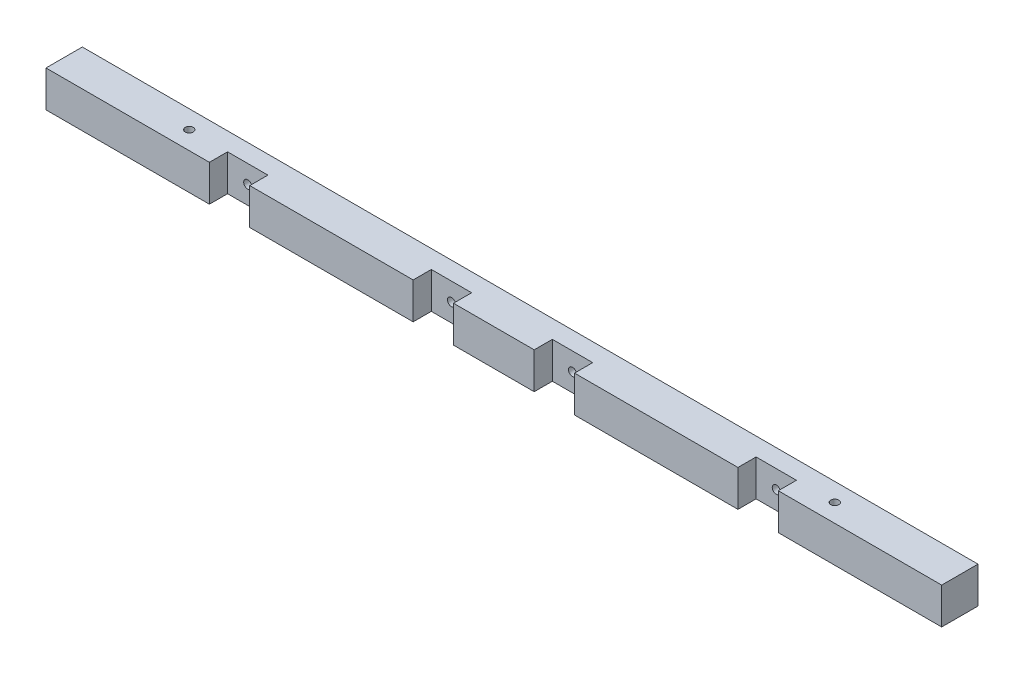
ISO-10303-21;
HEADER;
FILE_DESCRIPTION(('STEP AP214'),'2;1');
FILE_NAME('part.step','',(''),(''),'','','');
FILE_SCHEMA(('AUTOMOTIVE_DESIGN { 1 0 10303 214 1 1 1 1 }'));
ENDSEC;
DATA;
#1=APPLICATION_CONTEXT('core data for automotive mechanical design processes');
#2=APPLICATION_PROTOCOL_DEFINITION('international standard','automotive_design',2000,#1);
#3=PRODUCT_CONTEXT('',#1,'mechanical');
#4=PRODUCT('Part','Part','',(#3));
#5=PRODUCT_RELATED_PRODUCT_CATEGORY('part','',(#4));
#6=PRODUCT_DEFINITION_FORMATION('','',#4);
#7=PRODUCT_DEFINITION_CONTEXT('part definition',#1,'design');
#8=PRODUCT_DEFINITION('design','',#6,#7);
#9=PRODUCT_DEFINITION_SHAPE('','',#8);
#10=(LENGTH_UNIT() NAMED_UNIT(*) SI_UNIT(.MILLI.,.METRE.));
#11=(NAMED_UNIT(*) PLANE_ANGLE_UNIT() SI_UNIT($,.RADIAN.));
#12=(NAMED_UNIT(*) SI_UNIT($,.STERADIAN.) SOLID_ANGLE_UNIT());
#13=UNCERTAINTY_MEASURE_WITH_UNIT(LENGTH_MEASURE(1.E-05),#10,'distance_accuracy_value','');
#14=(GEOMETRIC_REPRESENTATION_CONTEXT(3) GLOBAL_UNCERTAINTY_ASSIGNED_CONTEXT((#13)) GLOBAL_UNIT_ASSIGNED_CONTEXT((#10,
#11,#12)) REPRESENTATION_CONTEXT('',''));
#15=CARTESIAN_POINT('',(0.,0.,0.));
#16=DIRECTION('',(0.,0.,1.));
#17=DIRECTION('',(1.,0.,0.));
#18=AXIS2_PLACEMENT_3D('',#15,#16,#17);
#19=CARTESIAN_POINT('',(0.,9.,9.));
#20=DIRECTION('',(0.,0.,-1.));
#21=DIRECTION('',(-1.,0.,0.));
#22=AXIS2_PLACEMENT_3D('',#19,#20,#21);
#23=PLANE('',#22);
#24=DIRECTION('',(1.,0.,0.));
#25=VECTOR('',#24,1.);
#26=CARTESIAN_POINT('',(0.,0.,9.));
#27=LINE('',#26,#25);
#28=CARTESIAN_POINT('',(131.,0.,9.));
#29=VERTEX_POINT('',#28);
#30=CARTESIAN_POINT('',(171.5,0.,9.));
#31=VERTEX_POINT('',#30);
#32=EDGE_CURVE('E374',#29,#31,#27,.T.);
#33=ORIENTED_EDGE('',*,*,#32,.T.);
#34=DIRECTION('',(0.,-1.,0.));
#35=VECTOR('',#34,1.);
#36=CARTESIAN_POINT('',(171.5,0.,9.));
#37=LINE('',#36,#35);
#38=CARTESIAN_POINT('',(171.5,9.,9.));
#39=VERTEX_POINT('',#38);
#40=EDGE_CURVE('E174',#39,#31,#37,.T.);
#41=ORIENTED_EDGE('',*,*,#40,.F.);
#42=DIRECTION('',(-1.,0.,0.));
#43=VECTOR('',#42,1.);
#44=CARTESIAN_POINT('',(0.,9.,9.));
#45=LINE('',#44,#43);
#46=CARTESIAN_POINT('',(131.,9.,9.));
#47=VERTEX_POINT('',#46);
#48=EDGE_CURVE('E321',#39,#47,#45,.T.);
#49=ORIENTED_EDGE('',*,*,#48,.T.);
#50=DIRECTION('',(0.,1.,0.));
#51=VECTOR('',#50,1.);
#52=CARTESIAN_POINT('',(131.,0.,9.));
#53=LINE('',#52,#51);
#54=EDGE_CURVE('E218',#29,#47,#53,.T.);
#55=ORIENTED_EDGE('',*,*,#54,.F.);
#56=EDGE_LOOP('',(#33,#41,#49,#55));
#57=FACE_BOUND('',#56,.T.);
#58=ADVANCED_FACE('F31',(#57),#23,.F.);
#59=CARTESIAN_POINT('',(101.,0.,9.));
#60=VERTEX_POINT('',#59);
#61=CARTESIAN_POINT('',(121.,0.,9.));
#62=VERTEX_POINT('',#61);
#63=EDGE_CURVE('E375',#60,#62,#27,.T.);
#64=ORIENTED_EDGE('',*,*,#63,.T.);
#65=DIRECTION('',(0.,-1.,0.));
#66=VECTOR('',#65,1.);
#67=CARTESIAN_POINT('',(121.,0.,9.));
#68=LINE('',#67,#66);
#69=CARTESIAN_POINT('',(121.,9.,9.));
#70=VERTEX_POINT('',#69);
#71=EDGE_CURVE('E211',#70,#62,#68,.T.);
#72=ORIENTED_EDGE('',*,*,#71,.F.);
#73=CARTESIAN_POINT('',(101.,9.,9.));
#74=VERTEX_POINT('',#73);
#75=EDGE_CURVE('E358',#70,#74,#45,.T.);
#76=ORIENTED_EDGE('',*,*,#75,.T.);
#77=DIRECTION('',(0.,1.,0.));
#78=VECTOR('',#77,1.);
#79=CARTESIAN_POINT('',(101.,0.,9.));
#80=LINE('',#79,#78);
#81=EDGE_CURVE('E249',#60,#74,#80,.T.);
#82=ORIENTED_EDGE('',*,*,#81,.F.);
#83=EDGE_LOOP('',(#64,#72,#76,#82));
#84=FACE_BOUND('',#83,.T.);
#85=ADVANCED_FACE('F392',(#84),#23,.F.);
#86=CARTESIAN_POINT('',(50.5,0.,9.));
#87=VERTEX_POINT('',#86);
#88=CARTESIAN_POINT('',(91.,0.,9.));
#89=VERTEX_POINT('',#88);
#90=EDGE_CURVE('E314',#87,#89,#27,.T.);
#91=ORIENTED_EDGE('',*,*,#90,.T.);
#92=DIRECTION('',(0.,-1.,0.));
#93=VECTOR('',#92,1.);
#94=CARTESIAN_POINT('',(91.,0.,9.));
#95=LINE('',#94,#93);
#96=CARTESIAN_POINT('',(91.,9.,9.));
#97=VERTEX_POINT('',#96);
#98=EDGE_CURVE('E242',#97,#89,#95,.T.);
#99=ORIENTED_EDGE('',*,*,#98,.F.);
#100=CARTESIAN_POINT('',(50.5,9.,9.));
#101=VERTEX_POINT('',#100);
#102=EDGE_CURVE('E357',#97,#101,#45,.T.);
#103=ORIENTED_EDGE('',*,*,#102,.T.);
#104=DIRECTION('',(0.,1.,0.));
#105=VECTOR('',#104,1.);
#106=CARTESIAN_POINT('',(50.5,9.,9.));
#107=LINE('',#106,#105);
#108=EDGE_CURVE('E282',#87,#101,#107,.T.);
#109=ORIENTED_EDGE('',*,*,#108,.F.);
#110=EDGE_LOOP('',(#91,#99,#103,#109));
#111=FACE_BOUND('',#110,.T.);
#112=ADVANCED_FACE('F397',(#111),#23,.F.);
#113=CARTESIAN_POINT('',(0.,0.,9.));
#114=VERTEX_POINT('',#113);
#115=CARTESIAN_POINT('',(40.5,0.,9.));
#116=VERTEX_POINT('',#115);
#117=EDGE_CURVE('E310',#114,#116,#27,.T.);
#118=ORIENTED_EDGE('',*,*,#117,.T.);
#119=DIRECTION('',(0.,-1.,0.));
#120=VECTOR('',#119,1.);
#121=CARTESIAN_POINT('',(40.5,9.,9.));
#122=LINE('',#121,#120);
#123=CARTESIAN_POINT('',(40.5,9.,9.));
#124=VERTEX_POINT('',#123);
#125=EDGE_CURVE('E275',#124,#116,#122,.T.);
#126=ORIENTED_EDGE('',*,*,#125,.F.);
#127=CARTESIAN_POINT('',(0.,9.,9.));
#128=VERTEX_POINT('',#127);
#129=EDGE_CURVE('E316',#124,#128,#45,.T.);
#130=ORIENTED_EDGE('',*,*,#129,.T.);
#131=DIRECTION('',(0.,-1.,0.));
#132=VECTOR('',#131,1.);
#133=CARTESIAN_POINT('',(0.,0.,9.));
#134=LINE('',#133,#132);
#135=EDGE_CURVE('E305',#128,#114,#134,.T.);
#136=ORIENTED_EDGE('',*,*,#135,.T.);
#137=EDGE_LOOP('',(#118,#126,#130,#136));
#138=FACE_BOUND('',#137,.T.);
#139=ADVANCED_FACE('F354',(#138),#23,.F.);
#140=CARTESIAN_POINT('',(0.,0.,9.));
#141=DIRECTION('',(1.,0.,0.));
#142=DIRECTION('',(0.,0.,-1.));
#143=AXIS2_PLACEMENT_3D('',#140,#141,#142);
#144=PLANE('',#143);
#145=DIRECTION('',(0.,-1.,0.));
#146=VECTOR('',#145,1.);
#147=CARTESIAN_POINT('',(0.,0.,0.));
#148=LINE('',#147,#146);
#149=CARTESIAN_POINT('',(0.,9.,0.));
#150=VERTEX_POINT('',#149);
#151=CARTESIAN_POINT('',(0.,0.,0.));
#152=VERTEX_POINT('',#151);
#153=EDGE_CURVE('E297',#150,#152,#148,.T.);
#154=ORIENTED_EDGE('',*,*,#153,.T.);
#155=DIRECTION('',(0.,0.,-1.));
#156=VECTOR('',#155,1.);
#157=CARTESIAN_POINT('',(0.,0.,9.));
#158=LINE('',#157,#156);
#159=EDGE_CURVE('E11',#114,#152,#158,.T.);
#160=ORIENTED_EDGE('',*,*,#159,.F.);
#161=ORIENTED_EDGE('',*,*,#135,.F.);
#162=DIRECTION('',(0.,0.,-1.));
#163=VECTOR('',#162,1.);
#164=CARTESIAN_POINT('',(0.,9.,9.));
#165=LINE('',#164,#163);
#166=EDGE_CURVE('E320',#128,#150,#165,.T.);
#167=ORIENTED_EDGE('',*,*,#166,.T.);
#168=EDGE_LOOP('',(#154,#160,#161,#167));
#169=FACE_BOUND('',#168,.T.);
#170=ADVANCED_FACE('F33',(#169),#144,.F.);
#171=CARTESIAN_POINT('',(0.,0.,9.));
#172=DIRECTION('',(0.,1.,0.));
#173=DIRECTION('',(0.,0.,1.));
#174=AXIS2_PLACEMENT_3D('',#171,#172,#173);
#175=PLANE('',#174);
#176=CARTESIAN_POINT('',(191.,0.,4.5));
#177=DIRECTION('',(0.,1.,0.));
#178=DIRECTION('',(0.,0.,1.));
#179=AXIS2_PLACEMENT_3D('',#176,#177,#178);
#180=CIRCLE('',#179,0.999999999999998);
#181=CARTESIAN_POINT('',(191.,0.,5.5));
#182=VERTEX_POINT('',#181);
#183=EDGE_CURVE('E564',#182,#182,#180,.T.);
#184=ORIENTED_EDGE('',*,*,#183,.T.);
#185=EDGE_LOOP('',(#184));
#186=FACE_BOUND('',#185,.T.);
#187=CARTESIAN_POINT('',(31.,0.,4.5));
#188=DIRECTION('',(0.,1.,0.));
#189=DIRECTION('',(0.,0.,1.));
#190=AXIS2_PLACEMENT_3D('',#187,#188,#189);
#191=CIRCLE('',#190,0.999999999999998);
#192=CARTESIAN_POINT('',(31.,0.,5.5));
#193=VERTEX_POINT('',#192);
#194=EDGE_CURVE('E572',#193,#193,#191,.T.);
#195=ORIENTED_EDGE('',*,*,#194,.T.);
#196=EDGE_LOOP('',(#195));
#197=FACE_BOUND('',#196,.T.);
#198=DIRECTION('',(1.,0.,0.));
#199=VECTOR('',#198,1.);
#200=CARTESIAN_POINT('',(171.5,0.,4.5));
#201=LINE('',#200,#199);
#202=CARTESIAN_POINT('',(171.5,0.,4.5));
#203=VERTEX_POINT('',#202);
#204=CARTESIAN_POINT('',(181.5,0.,4.5));
#205=VERTEX_POINT('',#204);
#206=EDGE_CURVE('E185',#203,#205,#201,.T.);
#207=ORIENTED_EDGE('',*,*,#206,.F.);
#208=DIRECTION('',(0.,0.,1.));
#209=VECTOR('',#208,1.);
#210=CARTESIAN_POINT('',(171.5,0.,4.5));
#211=LINE('',#210,#209);
#212=EDGE_CURVE('E168',#203,#31,#211,.T.);
#213=ORIENTED_EDGE('',*,*,#212,.T.);
#214=ORIENTED_EDGE('',*,*,#32,.F.);
#215=DIRECTION('',(0.,0.,1.));
#216=VECTOR('',#215,1.);
#217=CARTESIAN_POINT('',(131.,0.,4.5));
#218=LINE('',#217,#216);
#219=CARTESIAN_POINT('',(131.,0.,4.5));
#220=VERTEX_POINT('',#219);
#221=EDGE_CURVE('E54',#220,#29,#218,.T.);
#222=ORIENTED_EDGE('',*,*,#221,.F.);
#223=DIRECTION('',(1.,0.,0.));
#224=VECTOR('',#223,1.);
#225=CARTESIAN_POINT('',(121.,0.,4.5));
#226=LINE('',#225,#224);
#227=CARTESIAN_POINT('',(121.,0.,4.5));
#228=VERTEX_POINT('',#227);
#229=EDGE_CURVE('E217',#228,#220,#226,.T.);
#230=ORIENTED_EDGE('',*,*,#229,.F.);
#231=DIRECTION('',(0.,0.,1.));
#232=VECTOR('',#231,1.);
#233=CARTESIAN_POINT('',(121.,0.,4.5));
#234=LINE('',#233,#232);
#235=EDGE_CURVE('E227',#228,#62,#234,.T.);
#236=ORIENTED_EDGE('',*,*,#235,.T.);
#237=ORIENTED_EDGE('',*,*,#63,.F.);
#238=DIRECTION('',(0.,0.,1.));
#239=VECTOR('',#238,1.);
#240=CARTESIAN_POINT('',(101.,0.,4.5));
#241=LINE('',#240,#239);
#242=CARTESIAN_POINT('',(101.,0.,4.5));
#243=VERTEX_POINT('',#242);
#244=EDGE_CURVE('E268',#243,#60,#241,.T.);
#245=ORIENTED_EDGE('',*,*,#244,.F.);
#246=DIRECTION('',(1.,0.,0.));
#247=VECTOR('',#246,1.);
#248=CARTESIAN_POINT('',(91.,0.,4.5));
#249=LINE('',#248,#247);
#250=CARTESIAN_POINT('',(91.,0.,4.5));
#251=VERTEX_POINT('',#250);
#252=EDGE_CURVE('E248',#251,#243,#249,.T.);
#253=ORIENTED_EDGE('',*,*,#252,.F.);
#254=DIRECTION('',(0.,0.,1.));
#255=VECTOR('',#254,1.);
#256=CARTESIAN_POINT('',(91.,0.,4.5));
#257=LINE('',#256,#255);
#258=EDGE_CURVE('E258',#251,#89,#257,.T.);
#259=ORIENTED_EDGE('',*,*,#258,.T.);
#260=ORIENTED_EDGE('',*,*,#90,.F.);
#261=DIRECTION('',(0.,0.,1.));
#262=VECTOR('',#261,1.);
#263=CARTESIAN_POINT('',(50.5,0.,4.5));
#264=LINE('',#263,#262);
#265=CARTESIAN_POINT('',(50.5,0.,4.5));
#266=VERTEX_POINT('',#265);
#267=EDGE_CURVE('E301',#266,#87,#264,.T.);
#268=ORIENTED_EDGE('',*,*,#267,.F.);
#269=DIRECTION('',(1.,0.,0.));
#270=VECTOR('',#269,1.);
#271=CARTESIAN_POINT('',(40.5,0.,4.5));
#272=LINE('',#271,#270);
#273=CARTESIAN_POINT('',(40.5,0.,4.5));
#274=VERTEX_POINT('',#273);
#275=EDGE_CURVE('E281',#274,#266,#272,.T.);
#276=ORIENTED_EDGE('',*,*,#275,.F.);
#277=DIRECTION('',(0.,0.,1.));
#278=VECTOR('',#277,1.);
#279=CARTESIAN_POINT('',(40.5,0.,4.5));
#280=LINE('',#279,#278);
#281=EDGE_CURVE('E291',#274,#116,#280,.T.);
#282=ORIENTED_EDGE('',*,*,#281,.T.);
#283=ORIENTED_EDGE('',*,*,#117,.F.);
#284=ORIENTED_EDGE('',*,*,#159,.T.);
#285=DIRECTION('',(1.,0.,0.));
#286=VECTOR('',#285,1.);
#287=CARTESIAN_POINT('',(0.,0.,0.));
#288=LINE('',#287,#286);
#289=CARTESIAN_POINT('',(222.,0.,0.));
#290=VERTEX_POINT('',#289);
#291=EDGE_CURVE('E324',#152,#290,#288,.T.);
#292=ORIENTED_EDGE('',*,*,#291,.T.);
#293=DIRECTION('',(0.,0.,-1.));
#294=VECTOR('',#293,1.);
#295=CARTESIAN_POINT('',(222.,0.,9.));
#296=LINE('',#295,#294);
#297=CARTESIAN_POINT('',(222.,0.,9.));
#298=VERTEX_POINT('',#297);
#299=EDGE_CURVE('E39',#298,#290,#296,.T.);
#300=ORIENTED_EDGE('',*,*,#299,.F.);
#301=CARTESIAN_POINT('',(181.5,0.,9.));
#302=VERTEX_POINT('',#301);
#303=EDGE_CURVE('E308',#302,#298,#27,.T.);
#304=ORIENTED_EDGE('',*,*,#303,.F.);
#305=DIRECTION('',(0.,0.,1.));
#306=VECTOR('',#305,1.);
#307=CARTESIAN_POINT('',(181.5,0.,4.5));
#308=LINE('',#307,#306);
#309=EDGE_CURVE('E46',#205,#302,#308,.T.);
#310=ORIENTED_EDGE('',*,*,#309,.F.);
#311=EDGE_LOOP('',(#207,#213,#214,#222,#230,#236,#237,#245,#253,#259,#260,#268,#276,#282,#283,
#284,#292,#300,#304,#310));
#312=FACE_BOUND('',#311,.T.);
#313=ADVANCED_FACE('F190',(#186,#197,#312),#175,.F.);
#314=CARTESIAN_POINT('',(222.,0.,9.));
#315=DIRECTION('',(-1.,0.,0.));
#316=DIRECTION('',(0.,0.,1.));
#317=AXIS2_PLACEMENT_3D('',#314,#315,#316);
#318=PLANE('',#317);
#319=DIRECTION('',(0.,1.,0.));
#320=VECTOR('',#319,1.);
#321=CARTESIAN_POINT('',(222.,0.,0.));
#322=LINE('',#321,#320);
#323=CARTESIAN_POINT('',(222.,9.,0.));
#324=VERTEX_POINT('',#323);
#325=EDGE_CURVE('E326',#290,#324,#322,.T.);
#326=ORIENTED_EDGE('',*,*,#325,.T.);
#327=DIRECTION('',(0.,0.,-1.));
#328=VECTOR('',#327,1.);
#329=CARTESIAN_POINT('',(222.,9.,9.));
#330=LINE('',#329,#328);
#331=CARTESIAN_POINT('',(222.,9.,9.));
#332=VERTEX_POINT('',#331);
#333=EDGE_CURVE('E331',#332,#324,#330,.T.);
#334=ORIENTED_EDGE('',*,*,#333,.F.);
#335=DIRECTION('',(0.,1.,0.));
#336=VECTOR('',#335,1.);
#337=CARTESIAN_POINT('',(222.,0.,9.));
#338=LINE('',#337,#336);
#339=EDGE_CURVE('E313',#298,#332,#338,.T.);
#340=ORIENTED_EDGE('',*,*,#339,.F.);
#341=ORIENTED_EDGE('',*,*,#299,.T.);
#342=EDGE_LOOP('',(#326,#334,#340,#341));
#343=FACE_BOUND('',#342,.T.);
#344=ADVANCED_FACE('F338',(#343),#318,.F.);
#345=CARTESIAN_POINT('',(0.,9.,9.));
#346=DIRECTION('',(0.,-1.,0.));
#347=DIRECTION('',(0.,0.,-1.));
#348=AXIS2_PLACEMENT_3D('',#345,#346,#347);
#349=PLANE('',#348);
#350=CARTESIAN_POINT('',(191.,9.,4.5));
#351=DIRECTION('',(0.,1.,0.));
#352=DIRECTION('',(0.,0.,1.));
#353=AXIS2_PLACEMENT_3D('',#350,#351,#352);
#354=CIRCLE('',#353,0.999999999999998);
#355=CARTESIAN_POINT('',(191.,9.,5.5));
#356=VERTEX_POINT('',#355);
#357=EDGE_CURVE('E567',#356,#356,#354,.T.);
#358=ORIENTED_EDGE('',*,*,#357,.F.);
#359=EDGE_LOOP('',(#358));
#360=FACE_BOUND('',#359,.T.);
#361=CARTESIAN_POINT('',(31.,9.,4.5));
#362=DIRECTION('',(0.,1.,0.));
#363=DIRECTION('',(0.,0.,1.));
#364=AXIS2_PLACEMENT_3D('',#361,#362,#363);
#365=CIRCLE('',#364,0.999999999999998);
#366=CARTESIAN_POINT('',(31.,9.,5.5));
#367=VERTEX_POINT('',#366);
#368=EDGE_CURVE('E569',#367,#367,#365,.T.);
#369=ORIENTED_EDGE('',*,*,#368,.F.);
#370=EDGE_LOOP('',(#369));
#371=FACE_BOUND('',#370,.T.);
#372=ORIENTED_EDGE('',*,*,#48,.F.);
#373=DIRECTION('',(0.,0.,1.));
#374=VECTOR('',#373,1.);
#375=CARTESIAN_POINT('',(171.5,9.,4.5));
#376=LINE('',#375,#374);
#377=CARTESIAN_POINT('',(171.5,9.,4.5));
#378=VERTEX_POINT('',#377);
#379=EDGE_CURVE('E201',#378,#39,#376,.T.);
#380=ORIENTED_EDGE('',*,*,#379,.F.);
#381=DIRECTION('',(-1.,0.,0.));
#382=VECTOR('',#381,1.);
#383=CARTESIAN_POINT('',(171.5,9.,4.5));
#384=LINE('',#383,#382);
#385=CARTESIAN_POINT('',(181.5,9.,4.5));
#386=VERTEX_POINT('',#385);
#387=EDGE_CURVE('E179',#386,#378,#384,.T.);
#388=ORIENTED_EDGE('',*,*,#387,.F.);
#389=DIRECTION('',(0.,0.,1.));
#390=VECTOR('',#389,1.);
#391=CARTESIAN_POINT('',(181.5,9.,4.5));
#392=LINE('',#391,#390);
#393=CARTESIAN_POINT('',(181.5,9.,9.));
#394=VERTEX_POINT('',#393);
#395=EDGE_CURVE('E204',#386,#394,#392,.T.);
#396=ORIENTED_EDGE('',*,*,#395,.T.);
#397=EDGE_CURVE('E317',#332,#394,#45,.T.);
#398=ORIENTED_EDGE('',*,*,#397,.F.);
#399=ORIENTED_EDGE('',*,*,#333,.T.);
#400=DIRECTION('',(-1.,0.,0.));
#401=VECTOR('',#400,1.);
#402=CARTESIAN_POINT('',(0.,9.,0.));
#403=LINE('',#402,#401);
#404=EDGE_CURVE('E309',#324,#150,#403,.T.);
#405=ORIENTED_EDGE('',*,*,#404,.T.);
#406=ORIENTED_EDGE('',*,*,#166,.F.);
#407=ORIENTED_EDGE('',*,*,#129,.F.);
#408=DIRECTION('',(0.,0.,1.));
#409=VECTOR('',#408,1.);
#410=CARTESIAN_POINT('',(40.5,9.,4.5));
#411=LINE('',#410,#409);
#412=CARTESIAN_POINT('',(40.5,9.,4.5));
#413=VERTEX_POINT('',#412);
#414=EDGE_CURVE('E295',#413,#124,#411,.T.);
#415=ORIENTED_EDGE('',*,*,#414,.F.);
#416=DIRECTION('',(-1.,0.,0.));
#417=VECTOR('',#416,1.);
#418=CARTESIAN_POINT('',(40.5,9.,4.5));
#419=LINE('',#418,#417);
#420=CARTESIAN_POINT('',(50.5,9.,4.5));
#421=VERTEX_POINT('',#420);
#422=EDGE_CURVE('E288',#421,#413,#419,.T.);
#423=ORIENTED_EDGE('',*,*,#422,.F.);
#424=DIRECTION('',(0.,0.,1.));
#425=VECTOR('',#424,1.);
#426=CARTESIAN_POINT('',(50.5,9.,4.5));
#427=LINE('',#426,#425);
#428=EDGE_CURVE('E298',#421,#101,#427,.T.);
#429=ORIENTED_EDGE('',*,*,#428,.T.);
#430=ORIENTED_EDGE('',*,*,#102,.F.);
#431=DIRECTION('',(0.,0.,1.));
#432=VECTOR('',#431,1.);
#433=CARTESIAN_POINT('',(91.,9.,4.5));
#434=LINE('',#433,#432);
#435=CARTESIAN_POINT('',(91.,9.,4.5));
#436=VERTEX_POINT('',#435);
#437=EDGE_CURVE('E262',#436,#97,#434,.T.);
#438=ORIENTED_EDGE('',*,*,#437,.F.);
#439=DIRECTION('',(-1.,0.,0.));
#440=VECTOR('',#439,1.);
#441=CARTESIAN_POINT('',(91.,9.,4.5));
#442=LINE('',#441,#440);
#443=CARTESIAN_POINT('',(101.,9.,4.5));
#444=VERTEX_POINT('',#443);
#445=EDGE_CURVE('E255',#444,#436,#442,.T.);
#446=ORIENTED_EDGE('',*,*,#445,.F.);
#447=DIRECTION('',(0.,0.,1.));
#448=VECTOR('',#447,1.);
#449=CARTESIAN_POINT('',(101.,9.,4.5));
#450=LINE('',#449,#448);
#451=EDGE_CURVE('E265',#444,#74,#450,.T.);
#452=ORIENTED_EDGE('',*,*,#451,.T.);
#453=ORIENTED_EDGE('',*,*,#75,.F.);
#454=DIRECTION('',(0.,0.,1.));
#455=VECTOR('',#454,1.);
#456=CARTESIAN_POINT('',(121.,9.,4.5));
#457=LINE('',#456,#455);
#458=CARTESIAN_POINT('',(121.,9.,4.5));
#459=VERTEX_POINT('',#458);
#460=EDGE_CURVE('E230',#459,#70,#457,.T.);
#461=ORIENTED_EDGE('',*,*,#460,.F.);
#462=DIRECTION('',(-1.,0.,0.));
#463=VECTOR('',#462,1.);
#464=CARTESIAN_POINT('',(121.,9.,4.5));
#465=LINE('',#464,#463);
#466=CARTESIAN_POINT('',(131.,9.,4.5));
#467=VERTEX_POINT('',#466);
#468=EDGE_CURVE('E224',#467,#459,#465,.T.);
#469=ORIENTED_EDGE('',*,*,#468,.F.);
#470=DIRECTION('',(0.,0.,1.));
#471=VECTOR('',#470,1.);
#472=CARTESIAN_POINT('',(131.,9.,4.5));
#473=LINE('',#472,#471);
#474=EDGE_CURVE('E233',#467,#47,#473,.T.);
#475=ORIENTED_EDGE('',*,*,#474,.T.);
#476=EDGE_LOOP('',(#372,#380,#388,#396,#398,#399,#405,#406,#407,#415,#423,#429,#430,#438,#446,
#452,#453,#461,#469,#475));
#477=FACE_BOUND('',#476,.T.);
#478=ADVANCED_FACE('F347',(#360,#371,#477),#349,.F.);
#479=ORIENTED_EDGE('',*,*,#397,.T.);
#480=DIRECTION('',(0.,1.,0.));
#481=VECTOR('',#480,1.);
#482=CARTESIAN_POINT('',(181.5,0.,9.));
#483=LINE('',#482,#481);
#484=EDGE_CURVE('E188',#302,#394,#483,.T.);
#485=ORIENTED_EDGE('',*,*,#484,.F.);
#486=ORIENTED_EDGE('',*,*,#303,.T.);
#487=ORIENTED_EDGE('',*,*,#339,.T.);
#488=EDGE_LOOP('',(#479,#485,#486,#487));
#489=FACE_BOUND('',#488,.T.);
#490=ADVANCED_FACE('F378',(#489),#23,.F.);
#491=CARTESIAN_POINT('',(0.,9.,0.));
#492=DIRECTION('',(0.,0.,-1.));
#493=DIRECTION('',(-1.,0.,0.));
#494=AXIS2_PLACEMENT_3D('',#491,#492,#493);
#495=PLANE('',#494);
#496=CARTESIAN_POINT('',(176.5,4.5,0.));
#497=DIRECTION('',(0.,0.,1.));
#498=DIRECTION('',(1.,0.,0.));
#499=AXIS2_PLACEMENT_3D('',#496,#497,#498);
#500=CIRCLE('',#499,0.999999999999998);
#501=CARTESIAN_POINT('',(177.5,4.5,0.));
#502=VERTEX_POINT('',#501);
#503=EDGE_CURVE('E199',#502,#502,#500,.T.);
#504=ORIENTED_EDGE('',*,*,#503,.T.);
#505=EDGE_LOOP('',(#504));
#506=FACE_BOUND('',#505,.T.);
#507=CARTESIAN_POINT('',(126.,4.5,0.));
#508=DIRECTION('',(0.,0.,1.));
#509=DIRECTION('',(1.,0.,0.));
#510=AXIS2_PLACEMENT_3D('',#507,#508,#509);
#511=CIRCLE('',#510,0.999999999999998);
#512=CARTESIAN_POINT('',(127.,4.5,0.));
#513=VERTEX_POINT('',#512);
#514=EDGE_CURVE('E208',#513,#513,#511,.T.);
#515=ORIENTED_EDGE('',*,*,#514,.T.);
#516=EDGE_LOOP('',(#515));
#517=FACE_BOUND('',#516,.T.);
#518=CARTESIAN_POINT('',(96.,4.5,0.));
#519=DIRECTION('',(0.,0.,1.));
#520=DIRECTION('',(1.,0.,0.));
#521=AXIS2_PLACEMENT_3D('',#518,#519,#520);
#522=CIRCLE('',#521,0.999999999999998);
#523=CARTESIAN_POINT('',(97.,4.5,0.));
#524=VERTEX_POINT('',#523);
#525=EDGE_CURVE('E239',#524,#524,#522,.T.);
#526=ORIENTED_EDGE('',*,*,#525,.T.);
#527=EDGE_LOOP('',(#526));
#528=FACE_BOUND('',#527,.T.);
#529=CARTESIAN_POINT('',(45.5,4.5,0.));
#530=DIRECTION('',(0.,0.,1.));
#531=DIRECTION('',(1.,0.,0.));
#532=AXIS2_PLACEMENT_3D('',#529,#530,#531);
#533=CIRCLE('',#532,0.999999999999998);
#534=CARTESIAN_POINT('',(46.5,4.5,0.));
#535=VERTEX_POINT('',#534);
#536=EDGE_CURVE('E272',#535,#535,#533,.T.);
#537=ORIENTED_EDGE('',*,*,#536,.T.);
#538=EDGE_LOOP('',(#537));
#539=FACE_BOUND('',#538,.T.);
#540=ORIENTED_EDGE('',*,*,#153,.F.);
#541=ORIENTED_EDGE('',*,*,#404,.F.);
#542=ORIENTED_EDGE('',*,*,#325,.F.);
#543=ORIENTED_EDGE('',*,*,#291,.F.);
#544=EDGE_LOOP('',(#540,#541,#542,#543));
#545=FACE_BOUND('',#544,.T.);
#546=ADVANCED_FACE('F343',(#506,#517,#528,#539,#545),#495,.T.);
#547=CARTESIAN_POINT('',(40.5,9.,4.5));
#548=DIRECTION('',(-1.,0.,0.));
#549=DIRECTION('',(0.,0.,1.));
#550=AXIS2_PLACEMENT_3D('',#547,#548,#549);
#551=PLANE('',#550);
#552=ORIENTED_EDGE('',*,*,#125,.T.);
#553=ORIENTED_EDGE('',*,*,#281,.F.);
#554=DIRECTION('',(0.,-1.,0.));
#555=VECTOR('',#554,1.);
#556=CARTESIAN_POINT('',(40.5,9.,4.5));
#557=LINE('',#556,#555);
#558=EDGE_CURVE('E278',#413,#274,#557,.T.);
#559=ORIENTED_EDGE('',*,*,#558,.F.);
#560=ORIENTED_EDGE('',*,*,#414,.T.);
#561=EDGE_LOOP('',(#552,#553,#559,#560));
#562=FACE_BOUND('',#561,.T.);
#563=ADVANCED_FACE('F405',(#562),#551,.F.);
#564=CARTESIAN_POINT('',(50.5,9.,4.5));
#565=DIRECTION('',(1.,0.,0.));
#566=DIRECTION('',(0.,0.,-1.));
#567=AXIS2_PLACEMENT_3D('',#564,#565,#566);
#568=PLANE('',#567);
#569=ORIENTED_EDGE('',*,*,#108,.T.);
#570=ORIENTED_EDGE('',*,*,#428,.F.);
#571=DIRECTION('',(0.,1.,0.));
#572=VECTOR('',#571,1.);
#573=CARTESIAN_POINT('',(50.5,9.,4.5));
#574=LINE('',#573,#572);
#575=EDGE_CURVE('E285',#266,#421,#574,.T.);
#576=ORIENTED_EDGE('',*,*,#575,.F.);
#577=ORIENTED_EDGE('',*,*,#267,.T.);
#578=EDGE_LOOP('',(#569,#570,#576,#577));
#579=FACE_BOUND('',#578,.T.);
#580=ADVANCED_FACE('F430',(#579),#568,.F.);
#581=CARTESIAN_POINT('',(40.5,0.,4.5));
#582=DIRECTION('',(0.,0.,1.));
#583=DIRECTION('',(1.,0.,0.));
#584=AXIS2_PLACEMENT_3D('',#581,#582,#583);
#585=PLANE('',#584);
#586=CARTESIAN_POINT('',(45.5,4.5,4.5));
#587=DIRECTION('',(0.,0.,1.));
#588=DIRECTION('',(1.,0.,0.));
#589=AXIS2_PLACEMENT_3D('',#586,#587,#588);
#590=CIRCLE('',#589,0.999999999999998);
#591=CARTESIAN_POINT('',(46.5,4.5,4.5));
#592=VERTEX_POINT('',#591);
#593=EDGE_CURVE('E264',#592,#592,#590,.T.);
#594=ORIENTED_EDGE('',*,*,#593,.F.);
#595=EDGE_LOOP('',(#594));
#596=FACE_BOUND('',#595,.T.);
#597=ORIENTED_EDGE('',*,*,#558,.T.);
#598=ORIENTED_EDGE('',*,*,#275,.T.);
#599=ORIENTED_EDGE('',*,*,#575,.T.);
#600=ORIENTED_EDGE('',*,*,#422,.T.);
#601=EDGE_LOOP('',(#597,#598,#599,#600));
#602=FACE_BOUND('',#601,.T.);
#603=ADVANCED_FACE('F432',(#596,#602),#585,.T.);
#604=CARTESIAN_POINT('',(45.5,4.5,0.));
#605=DIRECTION('',(0.,0.,1.));
#606=DIRECTION('',(1.,0.,0.));
#607=AXIS2_PLACEMENT_3D('',#604,#605,#606);
#608=CYLINDRICAL_SURFACE('',#607,0.999999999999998);
#609=ORIENTED_EDGE('',*,*,#536,.F.);
#610=EDGE_LOOP('',(#609));
#611=FACE_BOUND('',#610,.T.);
#612=ORIENTED_EDGE('',*,*,#593,.T.);
#613=EDGE_LOOP('',(#612));
#614=FACE_BOUND('',#613,.T.);
#615=ADVANCED_FACE('F442',(#611,#614),#608,.F.);
#616=CARTESIAN_POINT('',(91.,0.,4.5));
#617=DIRECTION('',(-1.,0.,0.));
#618=DIRECTION('',(0.,0.,1.));
#619=AXIS2_PLACEMENT_3D('',#616,#617,#618);
#620=PLANE('',#619);
#621=ORIENTED_EDGE('',*,*,#98,.T.);
#622=ORIENTED_EDGE('',*,*,#258,.F.);
#623=DIRECTION('',(0.,-1.,0.));
#624=VECTOR('',#623,1.);
#625=CARTESIAN_POINT('',(91.,0.,4.5));
#626=LINE('',#625,#624);
#627=EDGE_CURVE('E245',#436,#251,#626,.T.);
#628=ORIENTED_EDGE('',*,*,#627,.F.);
#629=ORIENTED_EDGE('',*,*,#437,.T.);
#630=EDGE_LOOP('',(#621,#622,#628,#629));
#631=FACE_BOUND('',#630,.T.);
#632=ADVANCED_FACE('F423',(#631),#620,.F.);
#633=CARTESIAN_POINT('',(101.,0.,4.5));
#634=DIRECTION('',(1.,0.,0.));
#635=DIRECTION('',(0.,0.,-1.));
#636=AXIS2_PLACEMENT_3D('',#633,#634,#635);
#637=PLANE('',#636);
#638=ORIENTED_EDGE('',*,*,#81,.T.);
#639=ORIENTED_EDGE('',*,*,#451,.F.);
#640=DIRECTION('',(0.,1.,0.));
#641=VECTOR('',#640,1.);
#642=CARTESIAN_POINT('',(101.,0.,4.5));
#643=LINE('',#642,#641);
#644=EDGE_CURVE('E252',#243,#444,#643,.T.);
#645=ORIENTED_EDGE('',*,*,#644,.F.);
#646=ORIENTED_EDGE('',*,*,#244,.T.);
#647=EDGE_LOOP('',(#638,#639,#645,#646));
#648=FACE_BOUND('',#647,.T.);
#649=ADVANCED_FACE('F449',(#648),#637,.F.);
#650=CARTESIAN_POINT('',(91.,9.,4.5));
#651=DIRECTION('',(0.,0.,-1.));
#652=DIRECTION('',(-1.,0.,0.));
#653=AXIS2_PLACEMENT_3D('',#650,#651,#652);
#654=PLANE('',#653);
#655=CARTESIAN_POINT('',(96.,4.5,4.5));
#656=DIRECTION('',(0.,0.,1.));
#657=DIRECTION('',(1.,0.,0.));
#658=AXIS2_PLACEMENT_3D('',#655,#656,#657);
#659=CIRCLE('',#658,0.999999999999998);
#660=CARTESIAN_POINT('',(97.,4.5,4.5));
#661=VERTEX_POINT('',#660);
#662=EDGE_CURVE('E232',#661,#661,#659,.T.);
#663=ORIENTED_EDGE('',*,*,#662,.F.);
#664=EDGE_LOOP('',(#663));
#665=FACE_BOUND('',#664,.T.);
#666=ORIENTED_EDGE('',*,*,#627,.T.);
#667=ORIENTED_EDGE('',*,*,#252,.T.);
#668=ORIENTED_EDGE('',*,*,#644,.T.);
#669=ORIENTED_EDGE('',*,*,#445,.T.);
#670=EDGE_LOOP('',(#666,#667,#668,#669));
#671=FACE_BOUND('',#670,.T.);
#672=ADVANCED_FACE('F425',(#665,#671),#654,.F.);
#673=CARTESIAN_POINT('',(96.,4.5,0.));
#674=DIRECTION('',(0.,0.,1.));
#675=DIRECTION('',(1.,0.,0.));
#676=AXIS2_PLACEMENT_3D('',#673,#674,#675);
#677=CYLINDRICAL_SURFACE('',#676,0.999999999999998);
#678=ORIENTED_EDGE('',*,*,#525,.F.);
#679=EDGE_LOOP('',(#678));
#680=FACE_BOUND('',#679,.T.);
#681=ORIENTED_EDGE('',*,*,#662,.T.);
#682=EDGE_LOOP('',(#681));
#683=FACE_BOUND('',#682,.T.);
#684=ADVANCED_FACE('F455',(#680,#683),#677,.F.);
#685=CARTESIAN_POINT('',(121.,0.,4.5));
#686=DIRECTION('',(-1.,0.,0.));
#687=DIRECTION('',(0.,0.,1.));
#688=AXIS2_PLACEMENT_3D('',#685,#686,#687);
#689=PLANE('',#688);
#690=ORIENTED_EDGE('',*,*,#71,.T.);
#691=ORIENTED_EDGE('',*,*,#235,.F.);
#692=DIRECTION('',(0.,-1.,0.));
#693=VECTOR('',#692,1.);
#694=CARTESIAN_POINT('',(121.,0.,4.5));
#695=LINE('',#694,#693);
#696=EDGE_CURVE('E214',#459,#228,#695,.T.);
#697=ORIENTED_EDGE('',*,*,#696,.F.);
#698=ORIENTED_EDGE('',*,*,#460,.T.);
#699=EDGE_LOOP('',(#690,#691,#697,#698));
#700=FACE_BOUND('',#699,.T.);
#701=ADVANCED_FACE('F459',(#700),#689,.F.);
#702=CARTESIAN_POINT('',(131.,0.,4.5));
#703=DIRECTION('',(1.,0.,0.));
#704=DIRECTION('',(0.,0.,-1.));
#705=AXIS2_PLACEMENT_3D('',#702,#703,#704);
#706=PLANE('',#705);
#707=ORIENTED_EDGE('',*,*,#54,.T.);
#708=ORIENTED_EDGE('',*,*,#474,.F.);
#709=DIRECTION('',(0.,1.,0.));
#710=VECTOR('',#709,1.);
#711=CARTESIAN_POINT('',(131.,0.,4.5));
#712=LINE('',#711,#710);
#713=EDGE_CURVE('E221',#220,#467,#712,.T.);
#714=ORIENTED_EDGE('',*,*,#713,.F.);
#715=ORIENTED_EDGE('',*,*,#221,.T.);
#716=EDGE_LOOP('',(#707,#708,#714,#715));
#717=FACE_BOUND('',#716,.T.);
#718=ADVANCED_FACE('F368',(#717),#706,.F.);
#719=CARTESIAN_POINT('',(121.,9.,4.5));
#720=DIRECTION('',(0.,0.,-1.));
#721=DIRECTION('',(-1.,0.,0.));
#722=AXIS2_PLACEMENT_3D('',#719,#720,#721);
#723=PLANE('',#722);
#724=CARTESIAN_POINT('',(126.,4.5,4.5));
#725=DIRECTION('',(0.,0.,1.));
#726=DIRECTION('',(1.,0.,0.));
#727=AXIS2_PLACEMENT_3D('',#724,#725,#726);
#728=CIRCLE('',#727,0.999999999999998);
#729=CARTESIAN_POINT('',(127.,4.5,4.5));
#730=VERTEX_POINT('',#729);
#731=EDGE_CURVE('E203',#730,#730,#728,.T.);
#732=ORIENTED_EDGE('',*,*,#731,.F.);
#733=EDGE_LOOP('',(#732));
#734=FACE_BOUND('',#733,.T.);
#735=ORIENTED_EDGE('',*,*,#696,.T.);
#736=ORIENTED_EDGE('',*,*,#229,.T.);
#737=ORIENTED_EDGE('',*,*,#713,.T.);
#738=ORIENTED_EDGE('',*,*,#468,.T.);
#739=EDGE_LOOP('',(#735,#736,#737,#738));
#740=FACE_BOUND('',#739,.T.);
#741=ADVANCED_FACE('F372',(#734,#740),#723,.F.);
#742=CARTESIAN_POINT('',(126.,4.5,0.));
#743=DIRECTION('',(0.,0.,1.));
#744=DIRECTION('',(1.,0.,0.));
#745=AXIS2_PLACEMENT_3D('',#742,#743,#744);
#746=CYLINDRICAL_SURFACE('',#745,0.999999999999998);
#747=ORIENTED_EDGE('',*,*,#514,.F.);
#748=EDGE_LOOP('',(#747));
#749=FACE_BOUND('',#748,.T.);
#750=ORIENTED_EDGE('',*,*,#731,.T.);
#751=EDGE_LOOP('',(#750));
#752=FACE_BOUND('',#751,.T.);
#753=ADVANCED_FACE('F389',(#749,#752),#746,.F.);
#754=CARTESIAN_POINT('',(171.5,0.,4.5));
#755=DIRECTION('',(-1.,0.,0.));
#756=DIRECTION('',(0.,0.,1.));
#757=AXIS2_PLACEMENT_3D('',#754,#755,#756);
#758=PLANE('',#757);
#759=ORIENTED_EDGE('',*,*,#40,.T.);
#760=ORIENTED_EDGE('',*,*,#212,.F.);
#761=DIRECTION('',(0.,-1.,0.));
#762=VECTOR('',#761,1.);
#763=CARTESIAN_POINT('',(171.5,0.,4.5));
#764=LINE('',#763,#762);
#765=EDGE_CURVE('E171',#378,#203,#764,.T.);
#766=ORIENTED_EDGE('',*,*,#765,.F.);
#767=ORIENTED_EDGE('',*,*,#379,.T.);
#768=EDGE_LOOP('',(#759,#760,#766,#767));
#769=FACE_BOUND('',#768,.T.);
#770=ADVANCED_FACE('F170',(#769),#758,.F.);
#771=CARTESIAN_POINT('',(181.5,0.,4.5));
#772=DIRECTION('',(1.,0.,0.));
#773=DIRECTION('',(0.,0.,-1.));
#774=AXIS2_PLACEMENT_3D('',#771,#772,#773);
#775=PLANE('',#774);
#776=ORIENTED_EDGE('',*,*,#484,.T.);
#777=ORIENTED_EDGE('',*,*,#395,.F.);
#778=DIRECTION('',(0.,1.,0.));
#779=VECTOR('',#778,1.);
#780=CARTESIAN_POINT('',(181.5,0.,4.5));
#781=LINE('',#780,#779);
#782=EDGE_CURVE('E192',#205,#386,#781,.T.);
#783=ORIENTED_EDGE('',*,*,#782,.F.);
#784=ORIENTED_EDGE('',*,*,#309,.T.);
#785=EDGE_LOOP('',(#776,#777,#783,#784));
#786=FACE_BOUND('',#785,.T.);
#787=ADVANCED_FACE('F379',(#786),#775,.F.);
#788=CARTESIAN_POINT('',(171.5,9.,4.5));
#789=DIRECTION('',(0.,0.,-1.));
#790=DIRECTION('',(-1.,0.,0.));
#791=AXIS2_PLACEMENT_3D('',#788,#789,#790);
#792=PLANE('',#791);
#793=CARTESIAN_POINT('',(176.5,4.5,4.5));
#794=DIRECTION('',(0.,0.,1.));
#795=DIRECTION('',(1.,0.,0.));
#796=AXIS2_PLACEMENT_3D('',#793,#794,#795);
#797=CIRCLE('',#796,0.999999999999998);
#798=CARTESIAN_POINT('',(177.5,4.5,4.5));
#799=VERTEX_POINT('',#798);
#800=EDGE_CURVE('E575',#799,#799,#797,.T.);
#801=ORIENTED_EDGE('',*,*,#800,.F.);
#802=EDGE_LOOP('',(#801));
#803=FACE_BOUND('',#802,.T.);
#804=ORIENTED_EDGE('',*,*,#765,.T.);
#805=ORIENTED_EDGE('',*,*,#206,.T.);
#806=ORIENTED_EDGE('',*,*,#782,.T.);
#807=ORIENTED_EDGE('',*,*,#387,.T.);
#808=EDGE_LOOP('',(#804,#805,#806,#807));
#809=FACE_BOUND('',#808,.T.);
#810=ADVANCED_FACE('F183',(#803,#809),#792,.F.);
#811=CARTESIAN_POINT('',(176.5,4.5,0.));
#812=DIRECTION('',(0.,0.,1.));
#813=DIRECTION('',(1.,0.,0.));
#814=AXIS2_PLACEMENT_3D('',#811,#812,#813);
#815=CYLINDRICAL_SURFACE('',#814,0.999999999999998);
#816=ORIENTED_EDGE('',*,*,#503,.F.);
#817=EDGE_LOOP('',(#816));
#818=FACE_BOUND('',#817,.T.);
#819=ORIENTED_EDGE('',*,*,#800,.T.);
#820=EDGE_LOOP('',(#819));
#821=FACE_BOUND('',#820,.T.);
#822=ADVANCED_FACE('F386',(#818,#821),#815,.F.);
#823=CARTESIAN_POINT('',(31.,0.,4.5));
#824=DIRECTION('',(0.,1.,0.));
#825=DIRECTION('',(0.,0.,1.));
#826=AXIS2_PLACEMENT_3D('',#823,#824,#825);
#827=CYLINDRICAL_SURFACE('',#826,0.999999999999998);
#828=ORIENTED_EDGE('',*,*,#194,.F.);
#829=EDGE_LOOP('',(#828));
#830=FACE_BOUND('',#829,.T.);
#831=ORIENTED_EDGE('',*,*,#368,.T.);
#832=EDGE_LOOP('',(#831));
#833=FACE_BOUND('',#832,.T.);
#834=ADVANCED_FACE('F520',(#830,#833),#827,.F.);
#835=CARTESIAN_POINT('',(191.,0.,4.5));
#836=DIRECTION('',(0.,1.,0.));
#837=DIRECTION('',(0.,0.,1.));
#838=AXIS2_PLACEMENT_3D('',#835,#836,#837);
#839=CYLINDRICAL_SURFACE('',#838,0.999999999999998);
#840=ORIENTED_EDGE('',*,*,#183,.F.);
#841=EDGE_LOOP('',(#840));
#842=FACE_BOUND('',#841,.T.);
#843=ORIENTED_EDGE('',*,*,#357,.T.);
#844=EDGE_LOOP('',(#843));
#845=FACE_BOUND('',#844,.T.);
#846=ADVANCED_FACE('F530',(#842,#845),#839,.F.);
#847=CLOSED_SHELL('',(#58,#85,#112,#139,#170,#313,#344,#478,#490,#546,#563,#580,#603,#615,#632,
#649,#672,#684,#701,#718,#741,#753,#770,#787,#810,#822,#834,#846));
#848=MANIFOLD_SOLID_BREP('B2',#847);
#849=ADVANCED_BREP_SHAPE_REPRESENTATION('',(#18,#848),#14);
#850=SHAPE_DEFINITION_REPRESENTATION(#9,#849);
ENDSEC;
END-ISO-10303-21;
